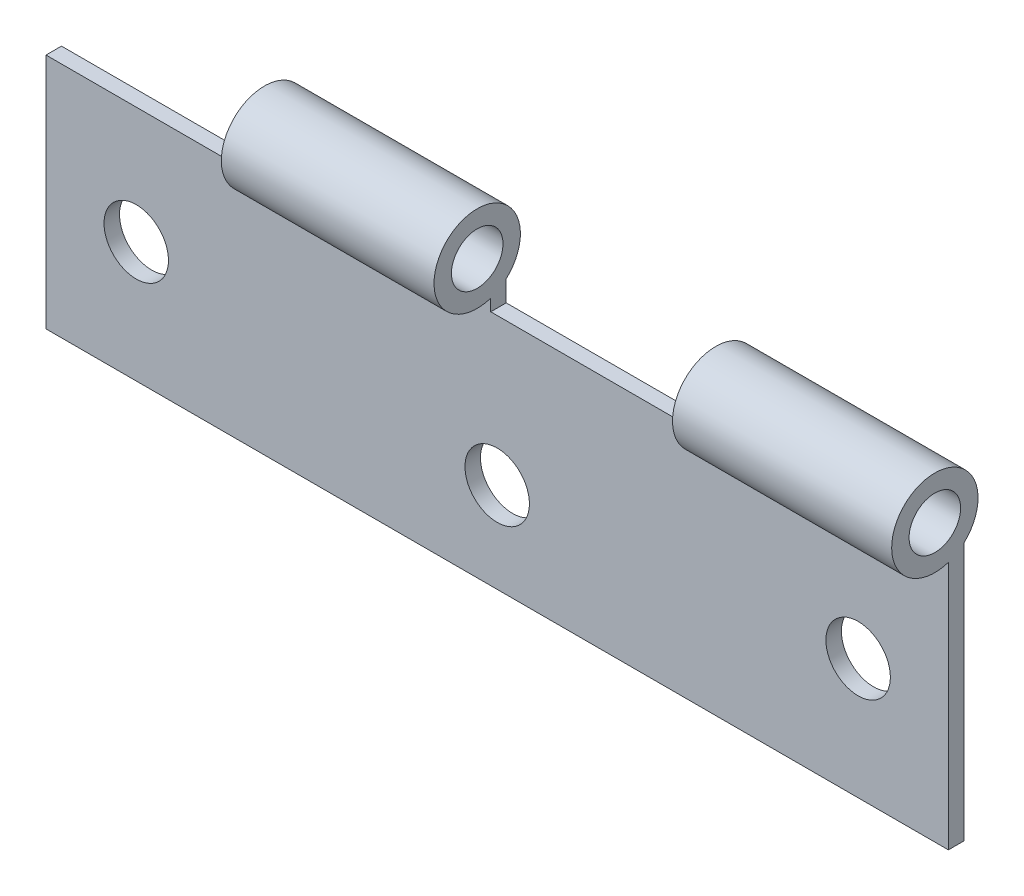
ISO-10303-21;
HEADER;
FILE_DESCRIPTION(('STEP AP214'),'2;1');
FILE_NAME('part.step','',(''),(''),'','','');
FILE_SCHEMA(('AUTOMOTIVE_DESIGN { 1 0 10303 214 1 1 1 1 }'));
ENDSEC;
DATA;
#1=APPLICATION_CONTEXT('core data for automotive mechanical design processes');
#2=APPLICATION_PROTOCOL_DEFINITION('international standard','automotive_design',2000,#1);
#3=PRODUCT_CONTEXT('',#1,'mechanical');
#4=PRODUCT('Part','Part','',(#3));
#5=PRODUCT_RELATED_PRODUCT_CATEGORY('part','',(#4));
#6=PRODUCT_DEFINITION_FORMATION('','',#4);
#7=PRODUCT_DEFINITION_CONTEXT('part definition',#1,'design');
#8=PRODUCT_DEFINITION('design','',#6,#7);
#9=PRODUCT_DEFINITION_SHAPE('','',#8);
#10=(LENGTH_UNIT() NAMED_UNIT(*) SI_UNIT(.MILLI.,.METRE.));
#11=(NAMED_UNIT(*) PLANE_ANGLE_UNIT() SI_UNIT($,.RADIAN.));
#12=(NAMED_UNIT(*) SI_UNIT($,.STERADIAN.) SOLID_ANGLE_UNIT());
#13=UNCERTAINTY_MEASURE_WITH_UNIT(LENGTH_MEASURE(1.E-05),#10,'distance_accuracy_value','');
#14=(GEOMETRIC_REPRESENTATION_CONTEXT(3) GLOBAL_UNCERTAINTY_ASSIGNED_CONTEXT((#13)) GLOBAL_UNIT_ASSIGNED_CONTEXT((#10,
#11,#12)) REPRESENTATION_CONTEXT('',''));
#15=CARTESIAN_POINT('',(0.,0.,0.));
#16=DIRECTION('',(0.,0.,1.));
#17=DIRECTION('',(1.,0.,0.));
#18=AXIS2_PLACEMENT_3D('',#15,#16,#17);
#19=CARTESIAN_POINT('',(35.,-3.85,2.25));
#20=DIRECTION('',(-1.,0.,0.));
#21=DIRECTION('',(0.,0.,1.));
#22=AXIS2_PLACEMENT_3D('',#19,#20,#21);
#23=CYLINDRICAL_SURFACE('',#22,3.35);
#24=CARTESIAN_POINT('',(-17.,-3.85,2.25));
#25=DIRECTION('',(1.,0.,0.));
#26=DIRECTION('',(0.,0.,-1.));
#27=AXIS2_PLACEMENT_3D('',#24,#25,#26);
#28=CIRCLE('',#27,3.35);
#29=CARTESIAN_POINT('',(-17.,-6.33193472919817,0.));
#30=VERTEX_POINT('',#29);
#31=CARTESIAN_POINT('',(-17.,-7.03119474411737,1.2));
#32=VERTEX_POINT('',#31);
#33=EDGE_CURVE('E116',#30,#32,#28,.T.);
#34=ORIENTED_EDGE('',*,*,#33,.T.);
#35=DIRECTION('',(-1.,0.,0.));
#36=VECTOR('',#35,1.);
#37=CARTESIAN_POINT('',(35.,-7.03119474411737,1.2));
#38=LINE('',#37,#36);
#39=CARTESIAN_POINT('',(-0.499999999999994,-7.03119474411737,1.2));
#40=VERTEX_POINT('',#39);
#41=EDGE_CURVE('E185',#40,#32,#38,.T.);
#42=ORIENTED_EDGE('',*,*,#41,.F.);
#43=CARTESIAN_POINT('',(-0.499999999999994,-3.85,2.25));
#44=DIRECTION('',(-1.,0.,0.));
#45=DIRECTION('',(0.,-1.,0.));
#46=AXIS2_PLACEMENT_3D('',#43,#44,#45);
#47=CIRCLE('',#46,3.35);
#48=CARTESIAN_POINT('',(-0.499999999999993,-6.33193472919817,0.));
#49=VERTEX_POINT('',#48);
#50=EDGE_CURVE('E154',#40,#49,#47,.T.);
#51=ORIENTED_EDGE('',*,*,#50,.T.);
#52=DIRECTION('',(-1.,0.,0.));
#53=VECTOR('',#52,1.);
#54=CARTESIAN_POINT('',(35.,-6.33193472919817,0.));
#55=LINE('',#54,#53);
#56=EDGE_CURVE('E189',#49,#30,#55,.T.);
#57=ORIENTED_EDGE('',*,*,#56,.T.);
#58=EDGE_LOOP('',(#34,#42,#51,#57));
#59=FACE_BOUND('',#58,.T.);
#60=ADVANCED_FACE('F34',(#59),#23,.T.);
#61=CARTESIAN_POINT('',(35.,-3.85,2.25));
#62=DIRECTION('',(-1.,0.,0.));
#63=DIRECTION('',(0.,0.,1.));
#64=AXIS2_PLACEMENT_3D('',#61,#62,#63);
#65=CYLINDRICAL_SURFACE('',#64,2.);
#66=CARTESIAN_POINT('',(-17.,-3.85,2.25));
#67=DIRECTION('',(1.,0.,0.));
#68=DIRECTION('',(0.,0.,-1.));
#69=AXIS2_PLACEMENT_3D('',#66,#67,#68);
#70=CIRCLE('',#69,2.);
#71=CARTESIAN_POINT('',(-17.,-3.85,0.249999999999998));
#72=VERTEX_POINT('',#71);
#73=EDGE_CURVE('E121',#72,#72,#70,.T.);
#74=ORIENTED_EDGE('',*,*,#73,.F.);
#75=EDGE_LOOP('',(#74));
#76=FACE_BOUND('',#75,.T.);
#77=CARTESIAN_POINT('',(-0.499999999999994,-3.85,2.25));
#78=DIRECTION('',(-1.,0.,0.));
#79=DIRECTION('',(0.,-1.,0.));
#80=AXIS2_PLACEMENT_3D('',#77,#78,#79);
#81=CIRCLE('',#80,2.);
#82=CARTESIAN_POINT('',(-0.499999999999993,-5.85,2.25));
#83=VERTEX_POINT('',#82);
#84=EDGE_CURVE('E150',#83,#83,#81,.T.);
#85=ORIENTED_EDGE('',*,*,#84,.F.);
#86=EDGE_LOOP('',(#85));
#87=FACE_BOUND('',#86,.T.);
#88=ADVANCED_FACE('F230',(#76,#87),#65,.F.);
#89=CARTESIAN_POINT('',(35.,-3.85,2.25));
#90=DIRECTION('',(1.,0.,0.));
#91=DIRECTION('',(0.,0.,-1.));
#92=AXIS2_PLACEMENT_3D('',#89,#90,#91);
#93=PLANE('',#92);
#94=DIRECTION('',(0.,1.,0.));
#95=VECTOR('',#94,1.);
#96=CARTESIAN_POINT('',(35.,-6.33193472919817,0.));
#97=LINE('',#96,#95);
#98=CARTESIAN_POINT('',(35.,-26.35,0.));
#99=VERTEX_POINT('',#98);
#100=CARTESIAN_POINT('',(35.,-6.33193472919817,0.));
#101=VERTEX_POINT('',#100);
#102=EDGE_CURVE('E166',#99,#101,#97,.T.);
#103=ORIENTED_EDGE('',*,*,#102,.T.);
#104=CARTESIAN_POINT('',(35.,-3.85,2.25));
#105=DIRECTION('',(1.,0.,0.));
#106=DIRECTION('',(0.,0.,-1.));
#107=AXIS2_PLACEMENT_3D('',#104,#105,#106);
#108=CIRCLE('',#107,3.35);
#109=CARTESIAN_POINT('',(35.,-7.03119474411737,1.2));
#110=VERTEX_POINT('',#109);
#111=EDGE_CURVE('E169',#101,#110,#108,.T.);
#112=ORIENTED_EDGE('',*,*,#111,.T.);
#113=DIRECTION('',(0.,-1.,0.));
#114=VECTOR('',#113,1.);
#115=CARTESIAN_POINT('',(35.,-7.03119474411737,1.2));
#116=LINE('',#115,#114);
#117=CARTESIAN_POINT('',(35.,-26.35,1.2));
#118=VERTEX_POINT('',#117);
#119=EDGE_CURVE('E172',#110,#118,#116,.T.);
#120=ORIENTED_EDGE('',*,*,#119,.T.);
#121=DIRECTION('',(0.,0.,-1.));
#122=VECTOR('',#121,1.);
#123=CARTESIAN_POINT('',(35.,-26.35,1.2));
#124=LINE('',#123,#122);
#125=EDGE_CURVE('E174',#118,#99,#124,.T.);
#126=ORIENTED_EDGE('',*,*,#125,.T.);
#127=EDGE_LOOP('',(#103,#112,#120,#126));
#128=FACE_BOUND('',#127,.T.);
#129=CARTESIAN_POINT('',(35.,-3.85,2.25));
#130=DIRECTION('',(1.,0.,0.));
#131=DIRECTION('',(0.,0.,-1.));
#132=AXIS2_PLACEMENT_3D('',#129,#130,#131);
#133=CIRCLE('',#132,2.);
#134=CARTESIAN_POINT('',(35.,-3.85,0.249999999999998));
#135=VERTEX_POINT('',#134);
#136=EDGE_CURVE('E163',#135,#135,#133,.T.);
#137=ORIENTED_EDGE('',*,*,#136,.F.);
#138=EDGE_LOOP('',(#137));
#139=FACE_BOUND('',#138,.T.);
#140=ADVANCED_FACE('F214',(#128,#139),#93,.T.);
#141=CARTESIAN_POINT('',(-35.,-3.85,2.25));
#142=DIRECTION('',(1.,0.,0.));
#143=DIRECTION('',(0.,0.,-1.));
#144=AXIS2_PLACEMENT_3D('',#141,#142,#143);
#145=PLANE('',#144);
#146=DIRECTION('',(0.,-1.,0.));
#147=VECTOR('',#146,1.);
#148=CARTESIAN_POINT('',(-35.,-7.03119474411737,1.2));
#149=LINE('',#148,#147);
#150=CARTESIAN_POINT('',(-35.,-7.95,1.2));
#151=VERTEX_POINT('',#150);
#152=CARTESIAN_POINT('',(-35.,-26.35,1.2));
#153=VERTEX_POINT('',#152);
#154=EDGE_CURVE('E178',#151,#153,#149,.T.);
#155=ORIENTED_EDGE('',*,*,#154,.F.);
#156=DIRECTION('',(0.,0.,-1.));
#157=VECTOR('',#156,1.);
#158=CARTESIAN_POINT('',(-35.,-7.95,2.25));
#159=LINE('',#158,#157);
#160=CARTESIAN_POINT('',(-35.,-7.95,0.));
#161=VERTEX_POINT('',#160);
#162=EDGE_CURVE('E49',#151,#161,#159,.T.);
#163=ORIENTED_EDGE('',*,*,#162,.T.);
#164=DIRECTION('',(0.,1.,0.));
#165=VECTOR('',#164,1.);
#166=CARTESIAN_POINT('',(-35.,-6.33193472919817,0.));
#167=LINE('',#166,#165);
#168=CARTESIAN_POINT('',(-35.,-26.35,0.));
#169=VERTEX_POINT('',#168);
#170=EDGE_CURVE('E130',#169,#161,#167,.T.);
#171=ORIENTED_EDGE('',*,*,#170,.F.);
#172=DIRECTION('',(0.,0.,-1.));
#173=VECTOR('',#172,1.);
#174=CARTESIAN_POINT('',(-35.,-26.35,1.2));
#175=LINE('',#174,#173);
#176=EDGE_CURVE('E170',#153,#169,#175,.T.);
#177=ORIENTED_EDGE('',*,*,#176,.F.);
#178=EDGE_LOOP('',(#155,#163,#171,#177));
#179=FACE_BOUND('',#178,.T.);
#180=ADVANCED_FACE('F206',(#179),#145,.F.);
#181=CARTESIAN_POINT('',(35.,-6.33193472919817,0.));
#182=DIRECTION('',(0.,0.,1.));
#183=DIRECTION('',(1.,0.,0.));
#184=AXIS2_PLACEMENT_3D('',#181,#182,#183);
#185=PLANE('',#184);
#186=CARTESIAN_POINT('',(-28.,-17.,0.));
#187=DIRECTION('',(0.,0.,1.));
#188=DIRECTION('',(1.,0.,0.));
#189=AXIS2_PLACEMENT_3D('',#186,#187,#188);
#190=CIRCLE('',#189,2.5);
#191=CARTESIAN_POINT('',(-25.5,-17.,0.));
#192=VERTEX_POINT('',#191);
#193=EDGE_CURVE('E125',#192,#192,#190,.T.);
#194=ORIENTED_EDGE('',*,*,#193,.T.);
#195=EDGE_LOOP('',(#194));
#196=FACE_BOUND('',#195,.T.);
#197=CARTESIAN_POINT('',(28.,-17.,0.));
#198=DIRECTION('',(0.,0.,1.));
#199=DIRECTION('',(1.,0.,0.));
#200=AXIS2_PLACEMENT_3D('',#197,#198,#199);
#201=CIRCLE('',#200,2.5);
#202=CARTESIAN_POINT('',(30.5,-17.,0.));
#203=VERTEX_POINT('',#202);
#204=EDGE_CURVE('E255',#203,#203,#201,.T.);
#205=ORIENTED_EDGE('',*,*,#204,.T.);
#206=EDGE_LOOP('',(#205));
#207=FACE_BOUND('',#206,.T.);
#208=CARTESIAN_POINT('',(0.,-19.35,0.));
#209=DIRECTION('',(0.,0.,1.));
#210=DIRECTION('',(1.,0.,0.));
#211=AXIS2_PLACEMENT_3D('',#208,#209,#210);
#212=CIRCLE('',#211,2.5);
#213=CARTESIAN_POINT('',(2.5,-19.35,0.));
#214=VERTEX_POINT('',#213);
#215=EDGE_CURVE('E258',#214,#214,#212,.T.);
#216=ORIENTED_EDGE('',*,*,#215,.T.);
#217=EDGE_LOOP('',(#216));
#218=FACE_BOUND('',#217,.T.);
#219=DIRECTION('',(1.,0.,0.));
#220=VECTOR('',#219,1.);
#221=CARTESIAN_POINT('',(35.,-7.95,0.));
#222=LINE('',#221,#220);
#223=CARTESIAN_POINT('',(-17.,-7.95,0.));
#224=VERTEX_POINT('',#223);
#225=EDGE_CURVE('E124',#161,#224,#222,.T.);
#226=ORIENTED_EDGE('',*,*,#225,.T.);
#227=DIRECTION('',(0.,1.,0.));
#228=VECTOR('',#227,1.);
#229=CARTESIAN_POINT('',(-17.,-6.33193472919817,0.));
#230=LINE('',#229,#228);
#231=EDGE_CURVE('E111',#224,#30,#230,.T.);
#232=ORIENTED_EDGE('',*,*,#231,.T.);
#233=ORIENTED_EDGE('',*,*,#56,.F.);
#234=DIRECTION('',(0.,-1.,0.));
#235=VECTOR('',#234,1.);
#236=CARTESIAN_POINT('',(-0.499999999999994,-6.33193472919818,0.));
#237=LINE('',#236,#235);
#238=CARTESIAN_POINT('',(-0.499999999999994,-7.95,0.));
#239=VERTEX_POINT('',#238);
#240=EDGE_CURVE('E157',#49,#239,#237,.T.);
#241=ORIENTED_EDGE('',*,*,#240,.T.);
#242=DIRECTION('',(1.,0.,0.));
#243=VECTOR('',#242,1.);
#244=CARTESIAN_POINT('',(35.,-7.95,0.));
#245=LINE('',#244,#243);
#246=CARTESIAN_POINT('',(18.,-7.95,0.));
#247=VERTEX_POINT('',#246);
#248=EDGE_CURVE('E160',#239,#247,#245,.T.);
#249=ORIENTED_EDGE('',*,*,#248,.T.);
#250=DIRECTION('',(0.,1.,0.));
#251=VECTOR('',#250,1.);
#252=CARTESIAN_POINT('',(18.,-6.33193472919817,0.));
#253=LINE('',#252,#251);
#254=CARTESIAN_POINT('',(18.,-6.33193472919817,0.));
#255=VERTEX_POINT('',#254);
#256=EDGE_CURVE('E147',#247,#255,#253,.T.);
#257=ORIENTED_EDGE('',*,*,#256,.T.);
#258=EDGE_CURVE('E190',#101,#255,#55,.T.);
#259=ORIENTED_EDGE('',*,*,#258,.F.);
#260=ORIENTED_EDGE('',*,*,#102,.F.);
#261=DIRECTION('',(-1.,0.,0.));
#262=VECTOR('',#261,1.);
#263=CARTESIAN_POINT('',(35.,-26.35,0.));
#264=LINE('',#263,#262);
#265=EDGE_CURVE('E176',#99,#169,#264,.T.);
#266=ORIENTED_EDGE('',*,*,#265,.T.);
#267=ORIENTED_EDGE('',*,*,#170,.T.);
#268=EDGE_LOOP('',(#226,#232,#233,#241,#249,#257,#259,#260,#266,#267));
#269=FACE_BOUND('',#268,.T.);
#270=ADVANCED_FACE('F36',(#196,#207,#218,#269),#185,.F.);
#271=CARTESIAN_POINT('',(18.,-3.85,2.25));
#272=DIRECTION('',(1.,0.,0.));
#273=DIRECTION('',(0.,0.,-1.));
#274=AXIS2_PLACEMENT_3D('',#271,#272,#273);
#275=CIRCLE('',#274,3.35);
#276=CARTESIAN_POINT('',(18.,-7.03119474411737,1.2));
#277=VERTEX_POINT('',#276);
#278=EDGE_CURVE('E145',#255,#277,#275,.T.);
#279=ORIENTED_EDGE('',*,*,#278,.T.);
#280=EDGE_CURVE('E186',#110,#277,#38,.T.);
#281=ORIENTED_EDGE('',*,*,#280,.F.);
#282=ORIENTED_EDGE('',*,*,#111,.F.);
#283=ORIENTED_EDGE('',*,*,#258,.T.);
#284=EDGE_LOOP('',(#279,#281,#282,#283));
#285=FACE_BOUND('',#284,.T.);
#286=ADVANCED_FACE('F220',(#285),#23,.T.);
#287=CARTESIAN_POINT('',(35.,-7.03119474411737,1.2));
#288=DIRECTION('',(0.,0.,-1.));
#289=DIRECTION('',(0.,1.,0.));
#290=AXIS2_PLACEMENT_3D('',#287,#288,#289);
#291=PLANE('',#290);
#292=CARTESIAN_POINT('',(-28.,-17.,1.2));
#293=DIRECTION('',(0.,0.,1.));
#294=DIRECTION('',(1.,0.,0.));
#295=AXIS2_PLACEMENT_3D('',#292,#293,#294);
#296=CIRCLE('',#295,2.5);
#297=CARTESIAN_POINT('',(-25.5,-17.,1.2));
#298=VERTEX_POINT('',#297);
#299=EDGE_CURVE('E260',#298,#298,#296,.T.);
#300=ORIENTED_EDGE('',*,*,#299,.F.);
#301=EDGE_LOOP('',(#300));
#302=FACE_BOUND('',#301,.T.);
#303=CARTESIAN_POINT('',(28.,-17.,1.2));
#304=DIRECTION('',(0.,0.,1.));
#305=DIRECTION('',(-1.,0.,0.));
#306=AXIS2_PLACEMENT_3D('',#303,#304,#305);
#307=CIRCLE('',#306,2.5);
#308=CARTESIAN_POINT('',(25.5,-17.,1.2));
#309=VERTEX_POINT('',#308);
#310=EDGE_CURVE('E264',#309,#309,#307,.T.);
#311=ORIENTED_EDGE('',*,*,#310,.F.);
#312=EDGE_LOOP('',(#311));
#313=FACE_BOUND('',#312,.T.);
#314=CARTESIAN_POINT('',(0.,-19.35,1.2));
#315=DIRECTION('',(0.,0.,1.));
#316=DIRECTION('',(1.,0.,0.));
#317=AXIS2_PLACEMENT_3D('',#314,#315,#316);
#318=CIRCLE('',#317,2.5);
#319=CARTESIAN_POINT('',(2.5,-19.35,1.2));
#320=VERTEX_POINT('',#319);
#321=EDGE_CURVE('E267',#320,#320,#318,.T.);
#322=ORIENTED_EDGE('',*,*,#321,.F.);
#323=EDGE_LOOP('',(#322));
#324=FACE_BOUND('',#323,.T.);
#325=ORIENTED_EDGE('',*,*,#41,.T.);
#326=DIRECTION('',(0.,-1.,0.));
#327=VECTOR('',#326,1.);
#328=CARTESIAN_POINT('',(-17.,-7.03119474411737,1.2));
#329=LINE('',#328,#327);
#330=CARTESIAN_POINT('',(-17.,-7.95,1.2));
#331=VERTEX_POINT('',#330);
#332=EDGE_CURVE('E12',#32,#331,#329,.T.);
#333=ORIENTED_EDGE('',*,*,#332,.T.);
#334=DIRECTION('',(-1.,0.,0.));
#335=VECTOR('',#334,1.);
#336=CARTESIAN_POINT('',(35.,-7.95,1.2));
#337=LINE('',#336,#335);
#338=EDGE_CURVE('E42',#331,#151,#337,.T.);
#339=ORIENTED_EDGE('',*,*,#338,.T.);
#340=ORIENTED_EDGE('',*,*,#154,.T.);
#341=DIRECTION('',(-1.,0.,0.));
#342=VECTOR('',#341,1.);
#343=CARTESIAN_POINT('',(35.,-26.35,1.2));
#344=LINE('',#343,#342);
#345=EDGE_CURVE('E182',#118,#153,#344,.T.);
#346=ORIENTED_EDGE('',*,*,#345,.F.);
#347=ORIENTED_EDGE('',*,*,#119,.F.);
#348=ORIENTED_EDGE('',*,*,#280,.T.);
#349=DIRECTION('',(0.,-1.,0.));
#350=VECTOR('',#349,1.);
#351=CARTESIAN_POINT('',(18.,-7.03119474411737,1.2));
#352=LINE('',#351,#350);
#353=CARTESIAN_POINT('',(18.,-7.95,1.2));
#354=VERTEX_POINT('',#353);
#355=EDGE_CURVE('E142',#277,#354,#352,.T.);
#356=ORIENTED_EDGE('',*,*,#355,.T.);
#357=DIRECTION('',(-1.,0.,0.));
#358=VECTOR('',#357,1.);
#359=CARTESIAN_POINT('',(35.,-7.95,1.2));
#360=LINE('',#359,#358);
#361=CARTESIAN_POINT('',(-0.499999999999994,-7.95,1.2));
#362=VERTEX_POINT('',#361);
#363=EDGE_CURVE('E193',#354,#362,#360,.T.);
#364=ORIENTED_EDGE('',*,*,#363,.T.);
#365=DIRECTION('',(0.,1.,0.));
#366=VECTOR('',#365,1.);
#367=CARTESIAN_POINT('',(-0.499999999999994,-7.03119474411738,1.2));
#368=LINE('',#367,#366);
#369=EDGE_CURVE('E151',#362,#40,#368,.T.);
#370=ORIENTED_EDGE('',*,*,#369,.T.);
#371=EDGE_LOOP('',(#325,#333,#339,#340,#346,#347,#348,#356,#364,#370));
#372=FACE_BOUND('',#371,.T.);
#373=ADVANCED_FACE('F202',(#302,#313,#324,#372),#291,.F.);
#374=CARTESIAN_POINT('',(35.,-26.35,1.2));
#375=DIRECTION('',(0.,1.,0.));
#376=DIRECTION('',(0.,0.,1.));
#377=AXIS2_PLACEMENT_3D('',#374,#375,#376);
#378=PLANE('',#377);
#379=ORIENTED_EDGE('',*,*,#176,.T.);
#380=ORIENTED_EDGE('',*,*,#265,.F.);
#381=ORIENTED_EDGE('',*,*,#125,.F.);
#382=ORIENTED_EDGE('',*,*,#345,.T.);
#383=EDGE_LOOP('',(#379,#380,#381,#382));
#384=FACE_BOUND('',#383,.T.);
#385=ADVANCED_FACE('F209',(#384),#378,.F.);
#386=CARTESIAN_POINT('',(18.,-3.85,2.25));
#387=DIRECTION('',(1.,0.,0.));
#388=DIRECTION('',(0.,0.,-1.));
#389=AXIS2_PLACEMENT_3D('',#386,#387,#388);
#390=CIRCLE('',#389,2.);
#391=CARTESIAN_POINT('',(18.,-3.85,0.249999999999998));
#392=VERTEX_POINT('',#391);
#393=EDGE_CURVE('E140',#392,#392,#390,.T.);
#394=ORIENTED_EDGE('',*,*,#393,.F.);
#395=EDGE_LOOP('',(#394));
#396=FACE_BOUND('',#395,.T.);
#397=ORIENTED_EDGE('',*,*,#136,.T.);
#398=EDGE_LOOP('',(#397));
#399=FACE_BOUND('',#398,.T.);
#400=ADVANCED_FACE('F236',(#396,#399),#65,.F.);
#401=CARTESIAN_POINT('',(-0.499999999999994,-7.95,-1.25));
#402=DIRECTION('',(0.,-1.,0.));
#403=DIRECTION('',(0.,0.,-1.));
#404=AXIS2_PLACEMENT_3D('',#401,#402,#403);
#405=PLANE('',#404);
#406=DIRECTION('',(0.,0.,1.));
#407=VECTOR('',#406,1.);
#408=CARTESIAN_POINT('',(-0.499999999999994,-7.95,-1.25));
#409=LINE('',#408,#407);
#410=EDGE_CURVE('E57',#239,#362,#409,.T.);
#411=ORIENTED_EDGE('',*,*,#410,.T.);
#412=ORIENTED_EDGE('',*,*,#363,.F.);
#413=DIRECTION('',(0.,0.,1.));
#414=VECTOR('',#413,1.);
#415=CARTESIAN_POINT('',(18.,-7.95,-1.25));
#416=LINE('',#415,#414);
#417=EDGE_CURVE('E137',#247,#354,#416,.T.);
#418=ORIENTED_EDGE('',*,*,#417,.F.);
#419=ORIENTED_EDGE('',*,*,#248,.F.);
#420=EDGE_LOOP('',(#411,#412,#418,#419));
#421=FACE_BOUND('',#420,.T.);
#422=ADVANCED_FACE('F224',(#421),#405,.F.);
#423=CARTESIAN_POINT('',(-0.499999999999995,-0.5,-1.25));
#424=DIRECTION('',(-1.,0.,0.));
#425=DIRECTION('',(0.,-1.,0.));
#426=AXIS2_PLACEMENT_3D('',#423,#424,#425);
#427=PLANE('',#426);
#428=ORIENTED_EDGE('',*,*,#84,.T.);
#429=EDGE_LOOP('',(#428));
#430=FACE_BOUND('',#429,.T.);
#431=ORIENTED_EDGE('',*,*,#50,.F.);
#432=ORIENTED_EDGE('',*,*,#369,.F.);
#433=ORIENTED_EDGE('',*,*,#410,.F.);
#434=ORIENTED_EDGE('',*,*,#240,.F.);
#435=EDGE_LOOP('',(#431,#432,#433,#434));
#436=FACE_BOUND('',#435,.T.);
#437=ADVANCED_FACE('F226',(#430,#436),#427,.F.);
#438=CARTESIAN_POINT('',(18.,-0.5,-1.25));
#439=DIRECTION('',(1.,0.,0.));
#440=DIRECTION('',(0.,0.,-1.));
#441=AXIS2_PLACEMENT_3D('',#438,#439,#440);
#442=PLANE('',#441);
#443=ORIENTED_EDGE('',*,*,#393,.T.);
#444=EDGE_LOOP('',(#443));
#445=FACE_BOUND('',#444,.T.);
#446=ORIENTED_EDGE('',*,*,#417,.T.);
#447=ORIENTED_EDGE('',*,*,#355,.F.);
#448=ORIENTED_EDGE('',*,*,#278,.F.);
#449=ORIENTED_EDGE('',*,*,#256,.F.);
#450=EDGE_LOOP('',(#446,#447,#448,#449));
#451=FACE_BOUND('',#450,.T.);
#452=ADVANCED_FACE('F222',(#445,#451),#442,.F.);
#453=CARTESIAN_POINT('',(-17.,-0.5,-1.25));
#454=DIRECTION('',(1.,0.,0.));
#455=DIRECTION('',(0.,0.,-1.));
#456=AXIS2_PLACEMENT_3D('',#453,#454,#455);
#457=PLANE('',#456);
#458=ORIENTED_EDGE('',*,*,#73,.T.);
#459=EDGE_LOOP('',(#458));
#460=FACE_BOUND('',#459,.T.);
#461=DIRECTION('',(0.,0.,1.));
#462=VECTOR('',#461,1.);
#463=CARTESIAN_POINT('',(-17.,-7.95,-1.25));
#464=LINE('',#463,#462);
#465=EDGE_CURVE('E115',#224,#331,#464,.T.);
#466=ORIENTED_EDGE('',*,*,#465,.T.);
#467=ORIENTED_EDGE('',*,*,#332,.F.);
#468=ORIENTED_EDGE('',*,*,#33,.F.);
#469=ORIENTED_EDGE('',*,*,#231,.F.);
#470=EDGE_LOOP('',(#466,#467,#468,#469));
#471=FACE_BOUND('',#470,.T.);
#472=ADVANCED_FACE('F113',(#460,#471),#457,.F.);
#473=CARTESIAN_POINT('',(-35.5,-7.95,-1.25));
#474=DIRECTION('',(0.,-1.,0.));
#475=DIRECTION('',(0.,0.,-1.));
#476=AXIS2_PLACEMENT_3D('',#473,#474,#475);
#477=PLANE('',#476);
#478=ORIENTED_EDGE('',*,*,#162,.F.);
#479=ORIENTED_EDGE('',*,*,#338,.F.);
#480=ORIENTED_EDGE('',*,*,#465,.F.);
#481=ORIENTED_EDGE('',*,*,#225,.F.);
#482=EDGE_LOOP('',(#478,#479,#480,#481));
#483=FACE_BOUND('',#482,.T.);
#484=ADVANCED_FACE('F123',(#483),#477,.F.);
#485=CARTESIAN_POINT('',(0.,-19.35,-1.25));
#486=DIRECTION('',(0.,0.,1.));
#487=DIRECTION('',(1.,0.,0.));
#488=AXIS2_PLACEMENT_3D('',#485,#486,#487);
#489=CYLINDRICAL_SURFACE('',#488,2.5);
#490=ORIENTED_EDGE('',*,*,#321,.T.);
#491=EDGE_LOOP('',(#490));
#492=FACE_BOUND('',#491,.T.);
#493=ORIENTED_EDGE('',*,*,#215,.F.);
#494=EDGE_LOOP('',(#493));
#495=FACE_BOUND('',#494,.T.);
#496=ADVANCED_FACE('F280',(#492,#495),#489,.F.);
#497=CARTESIAN_POINT('',(28.,-17.,-1.25));
#498=DIRECTION('',(0.,0.,1.));
#499=DIRECTION('',(1.,0.,0.));
#500=AXIS2_PLACEMENT_3D('',#497,#498,#499);
#501=CYLINDRICAL_SURFACE('',#500,2.5);
#502=ORIENTED_EDGE('',*,*,#310,.T.);
#503=EDGE_LOOP('',(#502));
#504=FACE_BOUND('',#503,.T.);
#505=ORIENTED_EDGE('',*,*,#204,.F.);
#506=EDGE_LOOP('',(#505));
#507=FACE_BOUND('',#506,.T.);
#508=ADVANCED_FACE('F274',(#504,#507),#501,.F.);
#509=CARTESIAN_POINT('',(-28.,-17.,-1.25));
#510=DIRECTION('',(0.,0.,1.));
#511=DIRECTION('',(1.,0.,0.));
#512=AXIS2_PLACEMENT_3D('',#509,#510,#511);
#513=CYLINDRICAL_SURFACE('',#512,2.5);
#514=ORIENTED_EDGE('',*,*,#299,.T.);
#515=EDGE_LOOP('',(#514));
#516=FACE_BOUND('',#515,.T.);
#517=ORIENTED_EDGE('',*,*,#193,.F.);
#518=EDGE_LOOP('',(#517));
#519=FACE_BOUND('',#518,.T.);
#520=ADVANCED_FACE('F287',(#516,#519),#513,.F.);
#521=CLOSED_SHELL('',(#60,#88,#140,#180,#270,#286,#373,#385,#400,#422,#437,#452,#472,#484,#496,
#508,#520));
#522=MANIFOLD_SOLID_BREP('B2',#521);
#523=ADVANCED_BREP_SHAPE_REPRESENTATION('',(#18,#522),#14);
#524=SHAPE_DEFINITION_REPRESENTATION(#9,#523);
ENDSEC;
END-ISO-10303-21;
